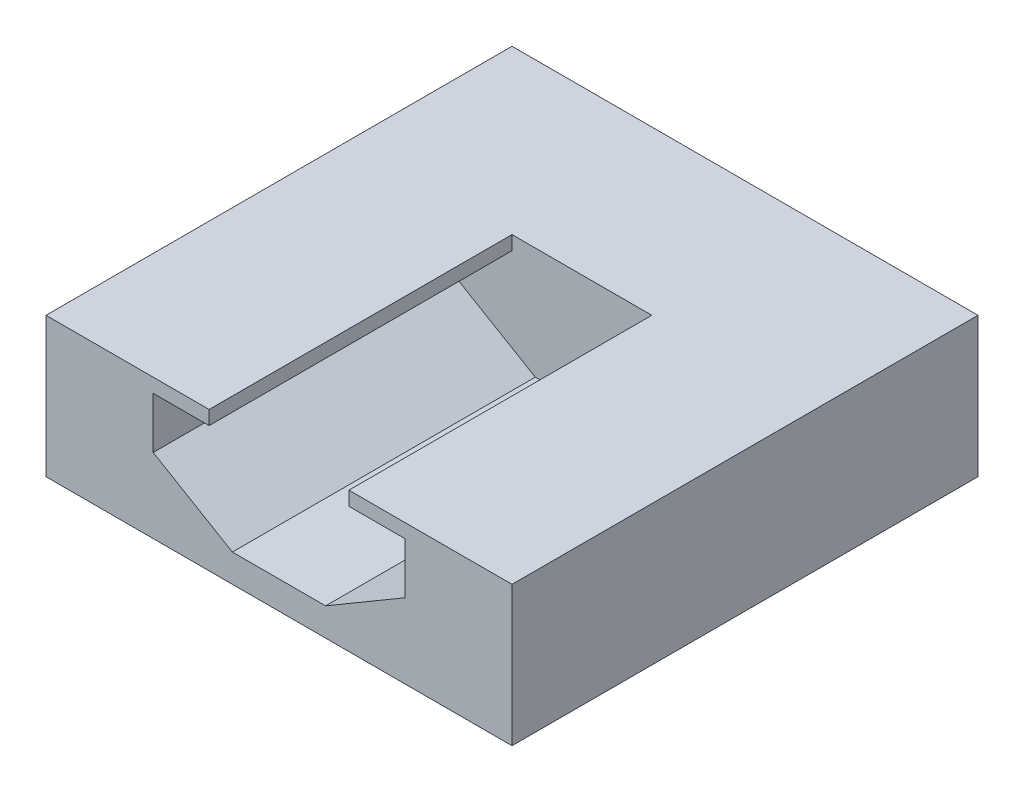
ISO-10303-21;
HEADER;
FILE_DESCRIPTION(('STEP AP214'),'2;1');
FILE_NAME('part.step','',(''),(''),'','','');
FILE_SCHEMA(('AUTOMOTIVE_DESIGN { 1 0 10303 214 1 1 1 1 }'));
ENDSEC;
DATA;
#1=APPLICATION_CONTEXT('core data for automotive mechanical design processes');
#2=APPLICATION_PROTOCOL_DEFINITION('international standard','automotive_design',2000,#1);
#3=PRODUCT_CONTEXT('',#1,'mechanical');
#4=PRODUCT('Part','Part','',(#3));
#5=PRODUCT_RELATED_PRODUCT_CATEGORY('part','',(#4));
#6=PRODUCT_DEFINITION_FORMATION('','',#4);
#7=PRODUCT_DEFINITION_CONTEXT('part definition',#1,'design');
#8=PRODUCT_DEFINITION('design','',#6,#7);
#9=PRODUCT_DEFINITION_SHAPE('','',#8);
#10=(LENGTH_UNIT() NAMED_UNIT(*) SI_UNIT(.MILLI.,.METRE.));
#11=(NAMED_UNIT(*) PLANE_ANGLE_UNIT() SI_UNIT($,.RADIAN.));
#12=(NAMED_UNIT(*) SI_UNIT($,.STERADIAN.) SOLID_ANGLE_UNIT());
#13=UNCERTAINTY_MEASURE_WITH_UNIT(LENGTH_MEASURE(1.E-05),#10,'distance_accuracy_value','');
#14=(GEOMETRIC_REPRESENTATION_CONTEXT(3) GLOBAL_UNCERTAINTY_ASSIGNED_CONTEXT((#13)) GLOBAL_UNIT_ASSIGNED_CONTEXT((#10,
#11,#12)) REPRESENTATION_CONTEXT('',''));
#15=CARTESIAN_POINT('',(0.,0.,0.));
#16=DIRECTION('',(0.,0.,1.));
#17=DIRECTION('',(1.,0.,0.));
#18=AXIS2_PLACEMENT_3D('',#15,#16,#17);
#19=CARTESIAN_POINT('',(25.,15.,-25.));
#20=DIRECTION('',(-1.,0.,0.));
#21=DIRECTION('',(0.,0.,1.));
#22=AXIS2_PLACEMENT_3D('',#19,#20,#21);
#23=PLANE('',#22);
#24=DIRECTION('',(0.,0.,-1.));
#25=VECTOR('',#24,1.);
#26=CARTESIAN_POINT('',(25.,0.,-25.));
#27=LINE('',#26,#25);
#28=CARTESIAN_POINT('',(25.,0.,25.));
#29=VERTEX_POINT('',#28);
#30=CARTESIAN_POINT('',(25.,0.,-25.));
#31=VERTEX_POINT('',#30);
#32=EDGE_CURVE('E216',#29,#31,#27,.T.);
#33=ORIENTED_EDGE('',*,*,#32,.T.);
#34=DIRECTION('',(0.,-1.,0.));
#35=VECTOR('',#34,1.);
#36=CARTESIAN_POINT('',(25.,15.,-25.));
#37=LINE('',#36,#35);
#38=CARTESIAN_POINT('',(25.,15.,-25.));
#39=VERTEX_POINT('',#38);
#40=EDGE_CURVE('E11',#39,#31,#37,.T.);
#41=ORIENTED_EDGE('',*,*,#40,.F.);
#42=DIRECTION('',(0.,0.,-1.));
#43=VECTOR('',#42,1.);
#44=CARTESIAN_POINT('',(25.,15.,-25.));
#45=LINE('',#44,#43);
#46=CARTESIAN_POINT('',(25.,15.,25.));
#47=VERTEX_POINT('',#46);
#48=EDGE_CURVE('E232',#47,#39,#45,.T.);
#49=ORIENTED_EDGE('',*,*,#48,.F.);
#50=DIRECTION('',(0.,-1.,0.));
#51=VECTOR('',#50,1.);
#52=CARTESIAN_POINT('',(25.,15.,25.));
#53=LINE('',#52,#51);
#54=EDGE_CURVE('E240',#47,#29,#53,.T.);
#55=ORIENTED_EDGE('',*,*,#54,.T.);
#56=EDGE_LOOP('',(#33,#41,#49,#55));
#57=FACE_BOUND('',#56,.T.);
#58=ADVANCED_FACE('F38',(#57),#23,.F.);
#59=CARTESIAN_POINT('',(-25.,15.,-25.));
#60=DIRECTION('',(0.,0.,1.));
#61=DIRECTION('',(1.,0.,0.));
#62=AXIS2_PLACEMENT_3D('',#59,#60,#61);
#63=PLANE('',#62);
#64=DIRECTION('',(-1.,0.,0.));
#65=VECTOR('',#64,1.);
#66=CARTESIAN_POINT('',(-25.,0.,-25.));
#67=LINE('',#66,#65);
#68=CARTESIAN_POINT('',(-25.,0.,-25.));
#69=VERTEX_POINT('',#68);
#70=EDGE_CURVE('E243',#31,#69,#67,.T.);
#71=ORIENTED_EDGE('',*,*,#70,.T.);
#72=DIRECTION('',(0.,-1.,0.));
#73=VECTOR('',#72,1.);
#74=CARTESIAN_POINT('',(-25.,15.,-25.));
#75=LINE('',#74,#73);
#76=CARTESIAN_POINT('',(-25.,15.,-25.));
#77=VERTEX_POINT('',#76);
#78=EDGE_CURVE('E45',#77,#69,#75,.T.);
#79=ORIENTED_EDGE('',*,*,#78,.F.);
#80=DIRECTION('',(-1.,0.,0.));
#81=VECTOR('',#80,1.);
#82=CARTESIAN_POINT('',(-25.,15.,-25.));
#83=LINE('',#82,#81);
#84=EDGE_CURVE('E90',#39,#77,#83,.T.);
#85=ORIENTED_EDGE('',*,*,#84,.F.);
#86=ORIENTED_EDGE('',*,*,#40,.T.);
#87=EDGE_LOOP('',(#71,#79,#85,#86));
#88=FACE_BOUND('',#87,.T.);
#89=ADVANCED_FACE('F299',(#88),#63,.F.);
#90=CARTESIAN_POINT('',(-25.,15.,-25.));
#91=DIRECTION('',(1.,0.,0.));
#92=DIRECTION('',(0.,0.,-1.));
#93=AXIS2_PLACEMENT_3D('',#90,#91,#92);
#94=PLANE('',#93);
#95=DIRECTION('',(0.,0.,1.));
#96=VECTOR('',#95,1.);
#97=CARTESIAN_POINT('',(-25.,0.,-25.));
#98=LINE('',#97,#96);
#99=CARTESIAN_POINT('',(-25.,0.,25.));
#100=VERTEX_POINT('',#99);
#101=EDGE_CURVE('E245',#69,#100,#98,.T.);
#102=ORIENTED_EDGE('',*,*,#101,.T.);
#103=DIRECTION('',(0.,-1.,0.));
#104=VECTOR('',#103,1.);
#105=CARTESIAN_POINT('',(-25.,15.,25.));
#106=LINE('',#105,#104);
#107=CARTESIAN_POINT('',(-25.,15.,25.));
#108=VERTEX_POINT('',#107);
#109=EDGE_CURVE('E249',#108,#100,#106,.T.);
#110=ORIENTED_EDGE('',*,*,#109,.F.);
#111=DIRECTION('',(0.,0.,1.));
#112=VECTOR('',#111,1.);
#113=CARTESIAN_POINT('',(-25.,15.,-25.));
#114=LINE('',#113,#112);
#115=EDGE_CURVE('E235',#77,#108,#114,.T.);
#116=ORIENTED_EDGE('',*,*,#115,.F.);
#117=ORIENTED_EDGE('',*,*,#78,.T.);
#118=EDGE_LOOP('',(#102,#110,#116,#117));
#119=FACE_BOUND('',#118,.T.);
#120=ADVANCED_FACE('F254',(#119),#94,.F.);
#121=CARTESIAN_POINT('',(-25.,15.,25.));
#122=DIRECTION('',(0.,0.,-1.));
#123=DIRECTION('',(-1.,0.,0.));
#124=AXIS2_PLACEMENT_3D('',#121,#122,#123);
#125=PLANE('',#124);
#126=DIRECTION('',(-1.,0.,0.));
#127=VECTOR('',#126,1.);
#128=CARTESIAN_POINT('',(-13.4984878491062,13.5,25.));
#129=LINE('',#128,#127);
#130=CARTESIAN_POINT('',(-7.5,13.5,25.));
#131=VERTEX_POINT('',#130);
#132=CARTESIAN_POINT('',(-13.4984878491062,13.5,25.));
#133=VERTEX_POINT('',#132);
#134=EDGE_CURVE('E206',#131,#133,#129,.T.);
#135=ORIENTED_EDGE('',*,*,#134,.F.);
#136=DIRECTION('',(0.,-1.,0.));
#137=VECTOR('',#136,1.);
#138=CARTESIAN_POINT('',(-7.5,13.5,25.));
#139=LINE('',#138,#137);
#140=CARTESIAN_POINT('',(-7.5,15.,25.));
#141=VERTEX_POINT('',#140);
#142=EDGE_CURVE('E203',#141,#131,#139,.T.);
#143=ORIENTED_EDGE('',*,*,#142,.F.);
#144=DIRECTION('',(1.,0.,0.));
#145=VECTOR('',#144,1.);
#146=CARTESIAN_POINT('',(-25.,15.,25.));
#147=LINE('',#146,#145);
#148=EDGE_CURVE('E237',#108,#141,#147,.T.);
#149=ORIENTED_EDGE('',*,*,#148,.F.);
#150=ORIENTED_EDGE('',*,*,#109,.T.);
#151=DIRECTION('',(1.,0.,0.));
#152=VECTOR('',#151,1.);
#153=CARTESIAN_POINT('',(-25.,0.,25.));
#154=LINE('',#153,#152);
#155=EDGE_CURVE('E83',#100,#29,#154,.T.);
#156=ORIENTED_EDGE('',*,*,#155,.T.);
#157=ORIENTED_EDGE('',*,*,#54,.F.);
#158=CARTESIAN_POINT('',(7.5,15.,25.));
#159=VERTEX_POINT('',#158);
#160=EDGE_CURVE('E61',#159,#47,#147,.T.);
#161=ORIENTED_EDGE('',*,*,#160,.F.);
#162=DIRECTION('',(0.,1.,0.));
#163=VECTOR('',#162,1.);
#164=CARTESIAN_POINT('',(7.5,13.5,25.));
#165=LINE('',#164,#163);
#166=CARTESIAN_POINT('',(7.5,13.5,25.));
#167=VERTEX_POINT('',#166);
#168=EDGE_CURVE('E201',#167,#159,#165,.T.);
#169=ORIENTED_EDGE('',*,*,#168,.F.);
#170=DIRECTION('',(-1.,0.,0.));
#171=VECTOR('',#170,1.);
#172=CARTESIAN_POINT('',(13.4984878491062,13.5,25.));
#173=LINE('',#172,#171);
#174=CARTESIAN_POINT('',(13.4984878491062,13.5,25.));
#175=VERTEX_POINT('',#174);
#176=EDGE_CURVE('E198',#175,#167,#173,.T.);
#177=ORIENTED_EDGE('',*,*,#176,.F.);
#178=DIRECTION('',(0.,1.,0.));
#179=VECTOR('',#178,1.);
#180=CARTESIAN_POINT('',(13.4984878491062,13.5,25.));
#181=LINE('',#180,#179);
#182=CARTESIAN_POINT('',(13.4984878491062,8.,25.));
#183=VERTEX_POINT('',#182);
#184=EDGE_CURVE('E195',#183,#175,#181,.T.);
#185=ORIENTED_EDGE('',*,*,#184,.F.);
#186=DIRECTION('',(0.861894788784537,0.507087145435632,0.));
#187=VECTOR('',#186,1.);
#188=CARTESIAN_POINT('',(13.4984878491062,8.,25.));
#189=LINE('',#188,#187);
#190=CARTESIAN_POINT('',(5.,3.,25.));
#191=VERTEX_POINT('',#190);
#192=EDGE_CURVE('E193',#191,#183,#189,.T.);
#193=ORIENTED_EDGE('',*,*,#192,.F.);
#194=DIRECTION('',(1.,0.,0.));
#195=VECTOR('',#194,1.);
#196=CARTESIAN_POINT('',(-5.,3.,25.));
#197=LINE('',#196,#195);
#198=CARTESIAN_POINT('',(-5.,3.,25.));
#199=VERTEX_POINT('',#198);
#200=EDGE_CURVE('E156',#199,#191,#197,.T.);
#201=ORIENTED_EDGE('',*,*,#200,.F.);
#202=DIRECTION('',(0.861894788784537,-0.507087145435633,0.));
#203=VECTOR('',#202,1.);
#204=CARTESIAN_POINT('',(-13.4984878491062,8.,25.));
#205=LINE('',#204,#203);
#206=CARTESIAN_POINT('',(-13.4984878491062,8.,25.));
#207=VERTEX_POINT('',#206);
#208=EDGE_CURVE('E175',#207,#199,#205,.T.);
#209=ORIENTED_EDGE('',*,*,#208,.F.);
#210=DIRECTION('',(0.,-1.,0.));
#211=VECTOR('',#210,1.);
#212=CARTESIAN_POINT('',(-13.4984878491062,13.5,25.));
#213=LINE('',#212,#211);
#214=EDGE_CURVE('E209',#133,#207,#213,.T.);
#215=ORIENTED_EDGE('',*,*,#214,.F.);
#216=EDGE_LOOP('',(#135,#143,#149,#150,#156,#157,#161,#169,#177,#185,#193,#201,#209,#215));
#217=FACE_BOUND('',#216,.T.);
#218=ADVANCED_FACE('F263',(#217),#125,.F.);
#219=CARTESIAN_POINT('',(0.,15.,0.));
#220=DIRECTION('',(0.,1.,0.));
#221=DIRECTION('',(0.,0.,1.));
#222=AXIS2_PLACEMENT_3D('',#219,#220,#221);
#223=PLANE('',#222);
#224=DIRECTION('',(0.,0.,1.));
#225=VECTOR('',#224,1.);
#226=CARTESIAN_POINT('',(-7.5,15.,-7.50000000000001));
#227=LINE('',#226,#225);
#228=CARTESIAN_POINT('',(-7.5,15.,-7.50000000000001));
#229=VERTEX_POINT('',#228);
#230=EDGE_CURVE('E223',#229,#141,#227,.T.);
#231=ORIENTED_EDGE('',*,*,#230,.F.);
#232=DIRECTION('',(-1.,0.,0.));
#233=VECTOR('',#232,1.);
#234=CARTESIAN_POINT('',(-7.5,15.,-7.50000000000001));
#235=LINE('',#234,#233);
#236=CARTESIAN_POINT('',(7.5,15.,-7.50000000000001));
#237=VERTEX_POINT('',#236);
#238=EDGE_CURVE('E182',#237,#229,#235,.T.);
#239=ORIENTED_EDGE('',*,*,#238,.F.);
#240=DIRECTION('',(0.,0.,1.));
#241=VECTOR('',#240,1.);
#242=CARTESIAN_POINT('',(7.5,15.,-7.50000000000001));
#243=LINE('',#242,#241);
#244=EDGE_CURVE('E225',#237,#159,#243,.T.);
#245=ORIENTED_EDGE('',*,*,#244,.T.);
#246=ORIENTED_EDGE('',*,*,#160,.T.);
#247=ORIENTED_EDGE('',*,*,#48,.T.);
#248=ORIENTED_EDGE('',*,*,#84,.T.);
#249=ORIENTED_EDGE('',*,*,#115,.T.);
#250=ORIENTED_EDGE('',*,*,#148,.T.);
#251=EDGE_LOOP('',(#231,#239,#245,#246,#247,#248,#249,#250));
#252=FACE_BOUND('',#251,.T.);
#253=ADVANCED_FACE('F271',(#252),#223,.T.);
#254=CARTESIAN_POINT('',(0.,0.,0.));
#255=DIRECTION('',(0.,1.,0.));
#256=DIRECTION('',(0.,0.,1.));
#257=AXIS2_PLACEMENT_3D('',#254,#255,#256);
#258=PLANE('',#257);
#259=ORIENTED_EDGE('',*,*,#32,.F.);
#260=ORIENTED_EDGE('',*,*,#155,.F.);
#261=ORIENTED_EDGE('',*,*,#101,.F.);
#262=ORIENTED_EDGE('',*,*,#70,.F.);
#263=EDGE_LOOP('',(#259,#260,#261,#262));
#264=FACE_BOUND('',#263,.T.);
#265=ADVANCED_FACE('F258',(#264),#258,.F.);
#266=CARTESIAN_POINT('',(-5.,3.,-7.50000000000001));
#267=DIRECTION('',(0.,-1.,0.));
#268=DIRECTION('',(1.,0.,0.));
#269=AXIS2_PLACEMENT_3D('',#266,#267,#268);
#270=PLANE('',#269);
#271=ORIENTED_EDGE('',*,*,#200,.T.);
#272=DIRECTION('',(0.,0.,1.));
#273=VECTOR('',#272,1.);
#274=CARTESIAN_POINT('',(5.,3.,-7.50000000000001));
#275=LINE('',#274,#273);
#276=CARTESIAN_POINT('',(5.,3.,-7.50000000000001));
#277=VERTEX_POINT('',#276);
#278=EDGE_CURVE('E149',#277,#191,#275,.T.);
#279=ORIENTED_EDGE('',*,*,#278,.F.);
#280=DIRECTION('',(1.,0.,0.));
#281=VECTOR('',#280,1.);
#282=CARTESIAN_POINT('',(5.,3.,-7.50000000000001));
#283=LINE('',#282,#281);
#284=CARTESIAN_POINT('',(-5.,3.,-7.50000000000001));
#285=VERTEX_POINT('',#284);
#286=EDGE_CURVE('E153',#285,#277,#283,.T.);
#287=ORIENTED_EDGE('',*,*,#286,.F.);
#288=DIRECTION('',(0.,0.,1.));
#289=VECTOR('',#288,1.);
#290=CARTESIAN_POINT('',(-5.,3.,-7.50000000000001));
#291=LINE('',#290,#289);
#292=EDGE_CURVE('E214',#285,#199,#291,.T.);
#293=ORIENTED_EDGE('',*,*,#292,.T.);
#294=EDGE_LOOP('',(#271,#279,#287,#293));
#295=FACE_BOUND('',#294,.T.);
#296=ADVANCED_FACE('F151',(#295),#270,.F.);
#297=CARTESIAN_POINT('',(-13.4984878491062,8.,-7.50000000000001));
#298=DIRECTION('',(-0.507087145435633,-0.861894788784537,0.));
#299=DIRECTION('',(0.861894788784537,-0.507087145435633,0.));
#300=AXIS2_PLACEMENT_3D('',#297,#298,#299);
#301=PLANE('',#300);
#302=ORIENTED_EDGE('',*,*,#208,.T.);
#303=ORIENTED_EDGE('',*,*,#292,.F.);
#304=DIRECTION('',(0.861894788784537,-0.507087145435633,0.));
#305=VECTOR('',#304,1.);
#306=CARTESIAN_POINT('',(-13.4984878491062,8.,-7.50000000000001));
#307=LINE('',#306,#305);
#308=CARTESIAN_POINT('',(-13.4984878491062,8.,-7.50000000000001));
#309=VERTEX_POINT('',#308);
#310=EDGE_CURVE('E161',#309,#285,#307,.T.);
#311=ORIENTED_EDGE('',*,*,#310,.F.);
#312=DIRECTION('',(0.,0.,1.));
#313=VECTOR('',#312,1.);
#314=CARTESIAN_POINT('',(-13.4984878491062,8.,-7.50000000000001));
#315=LINE('',#314,#313);
#316=EDGE_CURVE('E217',#309,#207,#315,.T.);
#317=ORIENTED_EDGE('',*,*,#316,.T.);
#318=EDGE_LOOP('',(#302,#303,#311,#317));
#319=FACE_BOUND('',#318,.T.);
#320=ADVANCED_FACE('F284',(#319),#301,.F.);
#321=CARTESIAN_POINT('',(-13.4984878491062,13.5,-7.50000000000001));
#322=DIRECTION('',(-1.,0.,0.));
#323=DIRECTION('',(0.,-1.,0.));
#324=AXIS2_PLACEMENT_3D('',#321,#322,#323);
#325=PLANE('',#324);
#326=ORIENTED_EDGE('',*,*,#214,.T.);
#327=ORIENTED_EDGE('',*,*,#316,.F.);
#328=DIRECTION('',(0.,-1.,0.));
#329=VECTOR('',#328,1.);
#330=CARTESIAN_POINT('',(-13.4984878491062,13.5,-7.50000000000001));
#331=LINE('',#330,#329);
#332=CARTESIAN_POINT('',(-13.4984878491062,13.5,-7.50000000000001));
#333=VERTEX_POINT('',#332);
#334=EDGE_CURVE('E190',#333,#309,#331,.T.);
#335=ORIENTED_EDGE('',*,*,#334,.F.);
#336=DIRECTION('',(0.,0.,1.));
#337=VECTOR('',#336,1.);
#338=CARTESIAN_POINT('',(-13.4984878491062,13.5,-7.50000000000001));
#339=LINE('',#338,#337);
#340=EDGE_CURVE('E219',#333,#133,#339,.T.);
#341=ORIENTED_EDGE('',*,*,#340,.T.);
#342=EDGE_LOOP('',(#326,#327,#335,#341));
#343=FACE_BOUND('',#342,.T.);
#344=ADVANCED_FACE('F281',(#343),#325,.F.);
#345=CARTESIAN_POINT('',(-13.4984878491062,13.5,-7.50000000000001));
#346=DIRECTION('',(0.,1.,0.));
#347=DIRECTION('',(0.,0.,1.));
#348=AXIS2_PLACEMENT_3D('',#345,#346,#347);
#349=PLANE('',#348);
#350=ORIENTED_EDGE('',*,*,#134,.T.);
#351=ORIENTED_EDGE('',*,*,#340,.F.);
#352=DIRECTION('',(-1.,0.,0.));
#353=VECTOR('',#352,1.);
#354=CARTESIAN_POINT('',(-13.4984878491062,13.5,-7.50000000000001));
#355=LINE('',#354,#353);
#356=CARTESIAN_POINT('',(-7.5,13.5,-7.50000000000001));
#357=VERTEX_POINT('',#356);
#358=EDGE_CURVE('E187',#357,#333,#355,.T.);
#359=ORIENTED_EDGE('',*,*,#358,.F.);
#360=DIRECTION('',(0.,0.,1.));
#361=VECTOR('',#360,1.);
#362=CARTESIAN_POINT('',(-7.5,13.5,-7.50000000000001));
#363=LINE('',#362,#361);
#364=EDGE_CURVE('E221',#357,#131,#363,.T.);
#365=ORIENTED_EDGE('',*,*,#364,.T.);
#366=EDGE_LOOP('',(#350,#351,#359,#365));
#367=FACE_BOUND('',#366,.T.);
#368=ADVANCED_FACE('F277',(#367),#349,.F.);
#369=CARTESIAN_POINT('',(-7.5,13.5,-7.50000000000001));
#370=DIRECTION('',(-1.,0.,0.));
#371=DIRECTION('',(0.,0.,1.));
#372=AXIS2_PLACEMENT_3D('',#369,#370,#371);
#373=PLANE('',#372);
#374=ORIENTED_EDGE('',*,*,#142,.T.);
#375=ORIENTED_EDGE('',*,*,#364,.F.);
#376=DIRECTION('',(0.,-1.,0.));
#377=VECTOR('',#376,1.);
#378=CARTESIAN_POINT('',(-7.5,13.5,-7.50000000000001));
#379=LINE('',#378,#377);
#380=EDGE_CURVE('E184',#229,#357,#379,.T.);
#381=ORIENTED_EDGE('',*,*,#380,.F.);
#382=ORIENTED_EDGE('',*,*,#230,.T.);
#383=EDGE_LOOP('',(#374,#375,#381,#382));
#384=FACE_BOUND('',#383,.T.);
#385=ADVANCED_FACE('F274',(#384),#373,.F.);
#386=CARTESIAN_POINT('',(7.5,13.5,-7.50000000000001));
#387=DIRECTION('',(1.,0.,0.));
#388=DIRECTION('',(0.,0.,-1.));
#389=AXIS2_PLACEMENT_3D('',#386,#387,#388);
#390=PLANE('',#389);
#391=ORIENTED_EDGE('',*,*,#168,.T.);
#392=ORIENTED_EDGE('',*,*,#244,.F.);
#393=DIRECTION('',(0.,1.,0.));
#394=VECTOR('',#393,1.);
#395=CARTESIAN_POINT('',(7.5,13.5,-7.50000000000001));
#396=LINE('',#395,#394);
#397=CARTESIAN_POINT('',(7.5,13.5,-7.50000000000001));
#398=VERTEX_POINT('',#397);
#399=EDGE_CURVE('E52',#398,#237,#396,.T.);
#400=ORIENTED_EDGE('',*,*,#399,.F.);
#401=DIRECTION('',(0.,0.,1.));
#402=VECTOR('',#401,1.);
#403=CARTESIAN_POINT('',(7.5,13.5,-7.50000000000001));
#404=LINE('',#403,#402);
#405=EDGE_CURVE('E227',#398,#167,#404,.T.);
#406=ORIENTED_EDGE('',*,*,#405,.T.);
#407=EDGE_LOOP('',(#391,#392,#400,#406));
#408=FACE_BOUND('',#407,.T.);
#409=ADVANCED_FACE('F268',(#408),#390,.F.);
#410=CARTESIAN_POINT('',(13.4984878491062,13.5,-7.50000000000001));
#411=DIRECTION('',(0.,1.,0.));
#412=DIRECTION('',(0.,0.,1.));
#413=AXIS2_PLACEMENT_3D('',#410,#411,#412);
#414=PLANE('',#413);
#415=ORIENTED_EDGE('',*,*,#176,.T.);
#416=ORIENTED_EDGE('',*,*,#405,.F.);
#417=DIRECTION('',(-1.,0.,0.));
#418=VECTOR('',#417,1.);
#419=CARTESIAN_POINT('',(13.4984878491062,13.5,-7.50000000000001));
#420=LINE('',#419,#418);
#421=CARTESIAN_POINT('',(13.4984878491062,13.5,-7.50000000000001));
#422=VERTEX_POINT('',#421);
#423=EDGE_CURVE('E179',#422,#398,#420,.T.);
#424=ORIENTED_EDGE('',*,*,#423,.F.);
#425=DIRECTION('',(0.,0.,1.));
#426=VECTOR('',#425,1.);
#427=CARTESIAN_POINT('',(13.4984878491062,13.5,-7.50000000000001));
#428=LINE('',#427,#426);
#429=EDGE_CURVE('E229',#422,#175,#428,.T.);
#430=ORIENTED_EDGE('',*,*,#429,.T.);
#431=EDGE_LOOP('',(#415,#416,#424,#430));
#432=FACE_BOUND('',#431,.T.);
#433=ADVANCED_FACE('F289',(#432),#414,.F.);
#434=CARTESIAN_POINT('',(13.4984878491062,13.5,-7.50000000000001));
#435=DIRECTION('',(1.,0.,0.));
#436=DIRECTION('',(0.,0.,-1.));
#437=AXIS2_PLACEMENT_3D('',#434,#435,#436);
#438=PLANE('',#437);
#439=ORIENTED_EDGE('',*,*,#184,.T.);
#440=ORIENTED_EDGE('',*,*,#429,.F.);
#441=DIRECTION('',(0.,1.,0.));
#442=VECTOR('',#441,1.);
#443=CARTESIAN_POINT('',(13.4984878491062,13.5,-7.50000000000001));
#444=LINE('',#443,#442);
#445=CARTESIAN_POINT('',(13.4984878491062,8.,-7.50000000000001));
#446=VERTEX_POINT('',#445);
#447=EDGE_CURVE('E168',#446,#422,#444,.T.);
#448=ORIENTED_EDGE('',*,*,#447,.F.);
#449=DIRECTION('',(0.,0.,1.));
#450=VECTOR('',#449,1.);
#451=CARTESIAN_POINT('',(13.4984878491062,8.,-7.50000000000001));
#452=LINE('',#451,#450);
#453=EDGE_CURVE('E160',#446,#183,#452,.T.);
#454=ORIENTED_EDGE('',*,*,#453,.T.);
#455=EDGE_LOOP('',(#439,#440,#448,#454));
#456=FACE_BOUND('',#455,.T.);
#457=ADVANCED_FACE('F286',(#456),#438,.F.);
#458=CARTESIAN_POINT('',(13.4984878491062,8.,-7.50000000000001));
#459=DIRECTION('',(0.507087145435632,-0.861894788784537,0.));
#460=DIRECTION('',(0.861894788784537,0.507087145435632,0.));
#461=AXIS2_PLACEMENT_3D('',#458,#459,#460);
#462=PLANE('',#461);
#463=ORIENTED_EDGE('',*,*,#192,.T.);
#464=ORIENTED_EDGE('',*,*,#453,.F.);
#465=DIRECTION('',(0.861894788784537,0.507087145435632,0.));
#466=VECTOR('',#465,1.);
#467=CARTESIAN_POINT('',(13.4984878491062,8.,-7.50000000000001));
#468=LINE('',#467,#466);
#469=EDGE_CURVE('E164',#277,#446,#468,.T.);
#470=ORIENTED_EDGE('',*,*,#469,.F.);
#471=ORIENTED_EDGE('',*,*,#278,.T.);
#472=EDGE_LOOP('',(#463,#464,#470,#471));
#473=FACE_BOUND('',#472,.T.);
#474=ADVANCED_FACE('F165',(#473),#462,.F.);
#475=CARTESIAN_POINT('',(0.,0.,-7.50000000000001));
#476=DIRECTION('',(0.,0.,1.));
#477=DIRECTION('',(1.,0.,0.));
#478=AXIS2_PLACEMENT_3D('',#475,#476,#477);
#479=PLANE('',#478);
#480=ORIENTED_EDGE('',*,*,#286,.T.);
#481=ORIENTED_EDGE('',*,*,#469,.T.);
#482=ORIENTED_EDGE('',*,*,#447,.T.);
#483=ORIENTED_EDGE('',*,*,#423,.T.);
#484=ORIENTED_EDGE('',*,*,#399,.T.);
#485=ORIENTED_EDGE('',*,*,#238,.T.);
#486=ORIENTED_EDGE('',*,*,#380,.T.);
#487=ORIENTED_EDGE('',*,*,#358,.T.);
#488=ORIENTED_EDGE('',*,*,#334,.T.);
#489=ORIENTED_EDGE('',*,*,#310,.T.);
#490=EDGE_LOOP('',(#480,#481,#482,#483,#484,#485,#486,#487,#488,#489));
#491=FACE_BOUND('',#490,.T.);
#492=ADVANCED_FACE('F171',(#491),#479,.T.);
#493=CLOSED_SHELL('',(#58,#89,#120,#218,#253,#265,#296,#320,#344,#368,#385,#409,#433,#457,#474,#492));
#494=MANIFOLD_SOLID_BREP('B2',#493);
#495=ADVANCED_BREP_SHAPE_REPRESENTATION('',(#18,#494),#14);
#496=SHAPE_DEFINITION_REPRESENTATION(#9,#495);
ENDSEC;
END-ISO-10303-21;
